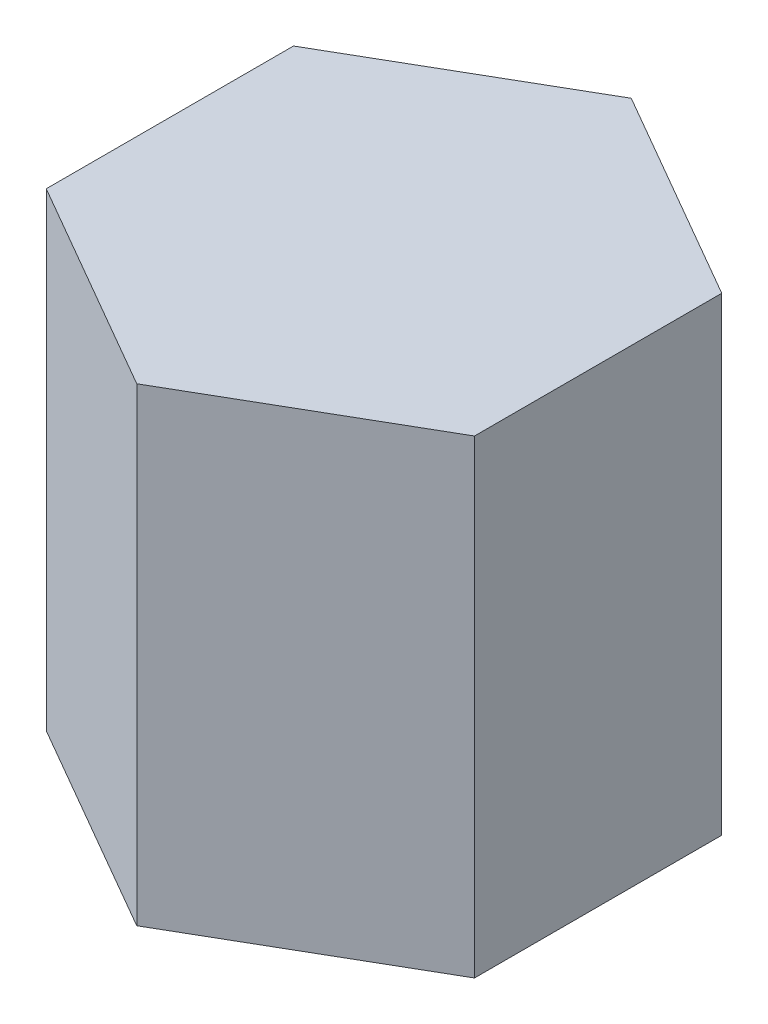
ISO-10303-21;
HEADER;
FILE_DESCRIPTION(('STEP AP214'),'2;1');
FILE_NAME('part.step','',(''),(''),'','','');
FILE_SCHEMA(('AUTOMOTIVE_DESIGN { 1 0 10303 214 1 1 1 1 }'));
ENDSEC;
DATA;
#1=APPLICATION_CONTEXT('core data for automotive mechanical design processes');
#2=APPLICATION_PROTOCOL_DEFINITION('international standard','automotive_design',2000,#1);
#3=PRODUCT_CONTEXT('',#1,'mechanical');
#4=PRODUCT('Part','Part','',(#3));
#5=PRODUCT_RELATED_PRODUCT_CATEGORY('part','',(#4));
#6=PRODUCT_DEFINITION_FORMATION('','',#4);
#7=PRODUCT_DEFINITION_CONTEXT('part definition',#1,'design');
#8=PRODUCT_DEFINITION('design','',#6,#7);
#9=PRODUCT_DEFINITION_SHAPE('','',#8);
#10=(LENGTH_UNIT() NAMED_UNIT(*) SI_UNIT(.MILLI.,.METRE.));
#11=(NAMED_UNIT(*) PLANE_ANGLE_UNIT() SI_UNIT($,.RADIAN.));
#12=(NAMED_UNIT(*) SI_UNIT($,.STERADIAN.) SOLID_ANGLE_UNIT());
#13=UNCERTAINTY_MEASURE_WITH_UNIT(LENGTH_MEASURE(1.E-05),#10,'distance_accuracy_value','');
#14=(GEOMETRIC_REPRESENTATION_CONTEXT(3) GLOBAL_UNCERTAINTY_ASSIGNED_CONTEXT((#13)) GLOBAL_UNIT_ASSIGNED_CONTEXT((#10,
#11,#12)) REPRESENTATION_CONTEXT('',''));
#15=CARTESIAN_POINT('',(0.,0.,0.));
#16=DIRECTION('',(0.,0.,1.));
#17=DIRECTION('',(1.,0.,0.));
#18=AXIS2_PLACEMENT_3D('',#15,#16,#17);
#19=CARTESIAN_POINT('',(50.1796313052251,110.,-28.9712236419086));
#20=DIRECTION('',(-0.499999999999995,0.,0.866025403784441));
#21=DIRECTION('',(0.866025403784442,0.,0.499999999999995));
#22=AXIS2_PLACEMENT_3D('',#19,#20,#21);
#23=PLANE('',#22);
#24=DIRECTION('',(-0.866025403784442,0.,-0.499999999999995));
#25=VECTOR('',#24,1.);
#26=CARTESIAN_POINT('',(50.1796313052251,0.,-28.9712236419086));
#27=LINE('',#26,#25);
#28=CARTESIAN_POINT('',(50.1796313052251,0.,-28.9712236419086));
#29=VERTEX_POINT('',#28);
#30=CARTESIAN_POINT('',(0.,0.,-57.9424472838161));
#31=VERTEX_POINT('',#30);
#32=EDGE_CURVE('E115',#29,#31,#27,.T.);
#33=ORIENTED_EDGE('',*,*,#32,.T.);
#34=DIRECTION('',(0.,-1.,0.));
#35=VECTOR('',#34,1.);
#36=CARTESIAN_POINT('',(0.,110.,-57.9424472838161));
#37=LINE('',#36,#35);
#38=CARTESIAN_POINT('',(0.,110.,-57.9424472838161));
#39=VERTEX_POINT('',#38);
#40=EDGE_CURVE('E11',#39,#31,#37,.T.);
#41=ORIENTED_EDGE('',*,*,#40,.F.);
#42=DIRECTION('',(-0.866025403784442,0.,-0.499999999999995));
#43=VECTOR('',#42,1.);
#44=CARTESIAN_POINT('',(50.1796313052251,110.,-28.9712236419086));
#45=LINE('',#44,#43);
#46=CARTESIAN_POINT('',(50.1796313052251,110.,-28.9712236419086));
#47=VERTEX_POINT('',#46);
#48=EDGE_CURVE('E125',#47,#39,#45,.T.);
#49=ORIENTED_EDGE('',*,*,#48,.F.);
#50=DIRECTION('',(0.,-1.,0.));
#51=VECTOR('',#50,1.);
#52=CARTESIAN_POINT('',(50.1796313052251,110.,-28.9712236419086));
#53=LINE('',#52,#51);
#54=EDGE_CURVE('E111',#47,#29,#53,.T.);
#55=ORIENTED_EDGE('',*,*,#54,.T.);
#56=EDGE_LOOP('',(#33,#41,#49,#55));
#57=FACE_BOUND('',#56,.T.);
#58=ADVANCED_FACE('F31',(#57),#23,.F.);
#59=CARTESIAN_POINT('',(0.,110.,-57.9424472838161));
#60=DIRECTION('',(0.500000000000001,0.,0.866025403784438));
#61=DIRECTION('',(0.866025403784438,0.,-0.500000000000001));
#62=AXIS2_PLACEMENT_3D('',#59,#60,#61);
#63=PLANE('',#62);
#64=DIRECTION('',(-0.866025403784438,0.,0.500000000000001));
#65=VECTOR('',#64,1.);
#66=CARTESIAN_POINT('',(0.,0.,-57.9424472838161));
#67=LINE('',#66,#65);
#68=CARTESIAN_POINT('',(-50.1796313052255,0.,-28.9712236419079));
#69=VERTEX_POINT('',#68);
#70=EDGE_CURVE('E118',#31,#69,#67,.T.);
#71=ORIENTED_EDGE('',*,*,#70,.T.);
#72=DIRECTION('',(0.,-1.,0.));
#73=VECTOR('',#72,1.);
#74=CARTESIAN_POINT('',(-50.1796313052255,110.,-28.9712236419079));
#75=LINE('',#74,#73);
#76=CARTESIAN_POINT('',(-50.1796313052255,110.,-28.9712236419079));
#77=VERTEX_POINT('',#76);
#78=EDGE_CURVE('E39',#77,#69,#75,.T.);
#79=ORIENTED_EDGE('',*,*,#78,.F.);
#80=DIRECTION('',(-0.866025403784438,0.,0.500000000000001));
#81=VECTOR('',#80,1.);
#82=CARTESIAN_POINT('',(0.,110.,-57.9424472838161));
#83=LINE('',#82,#81);
#84=EDGE_CURVE('E84',#39,#77,#83,.T.);
#85=ORIENTED_EDGE('',*,*,#84,.F.);
#86=ORIENTED_EDGE('',*,*,#40,.T.);
#87=EDGE_LOOP('',(#71,#79,#85,#86));
#88=FACE_BOUND('',#87,.T.);
#89=ADVANCED_FACE('F149',(#88),#63,.F.);
#90=CARTESIAN_POINT('',(-50.1796313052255,110.,-28.9712236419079));
#91=DIRECTION('',(1.,0.,0.));
#92=DIRECTION('',(0.,0.,-1.));
#93=AXIS2_PLACEMENT_3D('',#90,#91,#92);
#94=PLANE('',#93);
#95=DIRECTION('',(0.,0.,1.));
#96=VECTOR('',#95,1.);
#97=CARTESIAN_POINT('',(-50.1796313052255,0.,-28.9712236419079));
#98=LINE('',#97,#96);
#99=CARTESIAN_POINT('',(-50.1796313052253,0.,28.9712236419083));
#100=VERTEX_POINT('',#99);
#101=EDGE_CURVE('E120',#69,#100,#98,.T.);
#102=ORIENTED_EDGE('',*,*,#101,.T.);
#103=DIRECTION('',(0.,-1.,0.));
#104=VECTOR('',#103,1.);
#105=CARTESIAN_POINT('',(-50.1796313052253,110.,28.9712236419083));
#106=LINE('',#105,#104);
#107=CARTESIAN_POINT('',(-50.1796313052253,110.,28.9712236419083));
#108=VERTEX_POINT('',#107);
#109=EDGE_CURVE('E106',#108,#100,#106,.T.);
#110=ORIENTED_EDGE('',*,*,#109,.F.);
#111=DIRECTION('',(0.,0.,1.));
#112=VECTOR('',#111,1.);
#113=CARTESIAN_POINT('',(-50.1796313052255,110.,-28.9712236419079));
#114=LINE('',#113,#112);
#115=EDGE_CURVE('E97',#77,#108,#114,.T.);
#116=ORIENTED_EDGE('',*,*,#115,.F.);
#117=ORIENTED_EDGE('',*,*,#78,.T.);
#118=EDGE_LOOP('',(#102,#110,#116,#117));
#119=FACE_BOUND('',#118,.T.);
#120=ADVANCED_FACE('F131',(#119),#94,.F.);
#121=CARTESIAN_POINT('',(-50.1796313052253,110.,28.9712236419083));
#122=DIRECTION('',(0.499999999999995,0.,-0.866025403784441));
#123=DIRECTION('',(-0.866025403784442,0.,-0.499999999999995));
#124=AXIS2_PLACEMENT_3D('',#121,#122,#123);
#125=PLANE('',#124);
#126=DIRECTION('',(0.866025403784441,0.,0.499999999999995));
#127=VECTOR('',#126,1.);
#128=CARTESIAN_POINT('',(-50.1796313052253,0.,28.9712236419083));
#129=LINE('',#128,#127);
#130=CARTESIAN_POINT('',(4.04610181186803E-13,0.,57.9424472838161));
#131=VERTEX_POINT('',#130);
#132=EDGE_CURVE('E105',#100,#131,#129,.T.);
#133=ORIENTED_EDGE('',*,*,#132,.T.);
#134=DIRECTION('',(0.,-1.,0.));
#135=VECTOR('',#134,1.);
#136=CARTESIAN_POINT('',(4.04610181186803E-13,110.,57.9424472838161));
#137=LINE('',#136,#135);
#138=CARTESIAN_POINT('',(4.04610181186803E-13,110.,57.9424472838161));
#139=VERTEX_POINT('',#138);
#140=EDGE_CURVE('E102',#139,#131,#137,.T.);
#141=ORIENTED_EDGE('',*,*,#140,.F.);
#142=DIRECTION('',(0.866025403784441,0.,0.499999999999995));
#143=VECTOR('',#142,1.);
#144=CARTESIAN_POINT('',(-50.1796313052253,110.,28.9712236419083));
#145=LINE('',#144,#143);
#146=EDGE_CURVE('E91',#108,#139,#145,.T.);
#147=ORIENTED_EDGE('',*,*,#146,.F.);
#148=ORIENTED_EDGE('',*,*,#109,.T.);
#149=EDGE_LOOP('',(#133,#141,#147,#148));
#150=FACE_BOUND('',#149,.T.);
#151=ADVANCED_FACE('F103',(#150),#125,.F.);
#152=CARTESIAN_POINT('',(4.04610181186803E-13,110.,57.9424472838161));
#153=DIRECTION('',(-0.500000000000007,0.,-0.866025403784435));
#154=DIRECTION('',(-0.866025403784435,0.,0.500000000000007));
#155=AXIS2_PLACEMENT_3D('',#152,#153,#154);
#156=PLANE('',#155);
#157=DIRECTION('',(0.866025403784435,0.,-0.500000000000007));
#158=VECTOR('',#157,1.);
#159=CARTESIAN_POINT('',(4.04610181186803E-13,0.,57.9424472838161));
#160=LINE('',#159,#158);
#161=CARTESIAN_POINT('',(50.1796313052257,0.,28.9712236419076));
#162=VERTEX_POINT('',#161);
#163=EDGE_CURVE('E70',#131,#162,#160,.T.);
#164=ORIENTED_EDGE('',*,*,#163,.T.);
#165=DIRECTION('',(0.,-1.,0.));
#166=VECTOR('',#165,1.);
#167=CARTESIAN_POINT('',(50.1796313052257,110.,28.9712236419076));
#168=LINE('',#167,#166);
#169=CARTESIAN_POINT('',(50.1796313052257,110.,28.9712236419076));
#170=VERTEX_POINT('',#169);
#171=EDGE_CURVE('E107',#170,#162,#168,.T.);
#172=ORIENTED_EDGE('',*,*,#171,.F.);
#173=DIRECTION('',(0.866025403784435,0.,-0.500000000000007));
#174=VECTOR('',#173,1.);
#175=CARTESIAN_POINT('',(4.04610181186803E-13,110.,57.9424472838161));
#176=LINE('',#175,#174);
#177=EDGE_CURVE('E95',#139,#170,#176,.T.);
#178=ORIENTED_EDGE('',*,*,#177,.F.);
#179=ORIENTED_EDGE('',*,*,#140,.T.);
#180=EDGE_LOOP('',(#164,#172,#178,#179));
#181=FACE_BOUND('',#180,.T.);
#182=ADVANCED_FACE('F109',(#181),#156,.F.);
#183=CARTESIAN_POINT('',(50.1796313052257,110.,28.9712236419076));
#184=DIRECTION('',(-1.,0.,0.));
#185=DIRECTION('',(0.,0.,1.));
#186=AXIS2_PLACEMENT_3D('',#183,#184,#185);
#187=PLANE('',#186);
#188=DIRECTION('',(0.,0.,-1.));
#189=VECTOR('',#188,1.);
#190=CARTESIAN_POINT('',(50.1796313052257,0.,28.9712236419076));
#191=LINE('',#190,#189);
#192=EDGE_CURVE('E76',#162,#29,#191,.T.);
#193=ORIENTED_EDGE('',*,*,#192,.T.);
#194=ORIENTED_EDGE('',*,*,#54,.F.);
#195=DIRECTION('',(0.,0.,-1.));
#196=VECTOR('',#195,1.);
#197=CARTESIAN_POINT('',(50.1796313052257,110.,28.9712236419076));
#198=LINE('',#197,#196);
#199=EDGE_CURVE('E47',#170,#47,#198,.T.);
#200=ORIENTED_EDGE('',*,*,#199,.F.);
#201=ORIENTED_EDGE('',*,*,#171,.T.);
#202=EDGE_LOOP('',(#193,#194,#200,#201));
#203=FACE_BOUND('',#202,.T.);
#204=ADVANCED_FACE('F138',(#203),#187,.F.);
#205=CARTESIAN_POINT('',(0.,110.,-57.9424472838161));
#206=DIRECTION('',(0.,1.,0.));
#207=DIRECTION('',(0.,0.,1.));
#208=AXIS2_PLACEMENT_3D('',#205,#206,#207);
#209=PLANE('',#208);
#210=ORIENTED_EDGE('',*,*,#48,.T.);
#211=ORIENTED_EDGE('',*,*,#84,.T.);
#212=ORIENTED_EDGE('',*,*,#115,.T.);
#213=ORIENTED_EDGE('',*,*,#146,.T.);
#214=ORIENTED_EDGE('',*,*,#177,.T.);
#215=ORIENTED_EDGE('',*,*,#199,.T.);
#216=EDGE_LOOP('',(#210,#211,#212,#213,#214,#215));
#217=FACE_BOUND('',#216,.T.);
#218=ADVANCED_FACE('F93',(#217),#209,.T.);
#219=CARTESIAN_POINT('',(0.,0.,-57.9424472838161));
#220=DIRECTION('',(0.,1.,0.));
#221=DIRECTION('',(0.,0.,1.));
#222=AXIS2_PLACEMENT_3D('',#219,#220,#221);
#223=PLANE('',#222);
#224=ORIENTED_EDGE('',*,*,#32,.F.);
#225=ORIENTED_EDGE('',*,*,#192,.F.);
#226=ORIENTED_EDGE('',*,*,#163,.F.);
#227=ORIENTED_EDGE('',*,*,#132,.F.);
#228=ORIENTED_EDGE('',*,*,#101,.F.);
#229=ORIENTED_EDGE('',*,*,#70,.F.);
#230=EDGE_LOOP('',(#224,#225,#226,#227,#228,#229));
#231=FACE_BOUND('',#230,.T.);
#232=ADVANCED_FACE('F134',(#231),#223,.F.);
#233=CLOSED_SHELL('',(#58,#89,#120,#151,#182,#204,#218,#232));
#234=MANIFOLD_SOLID_BREP('B2',#233);
#235=ADVANCED_BREP_SHAPE_REPRESENTATION('',(#18,#234),#14);
#236=SHAPE_DEFINITION_REPRESENTATION(#9,#235);
ENDSEC;
END-ISO-10303-21;
